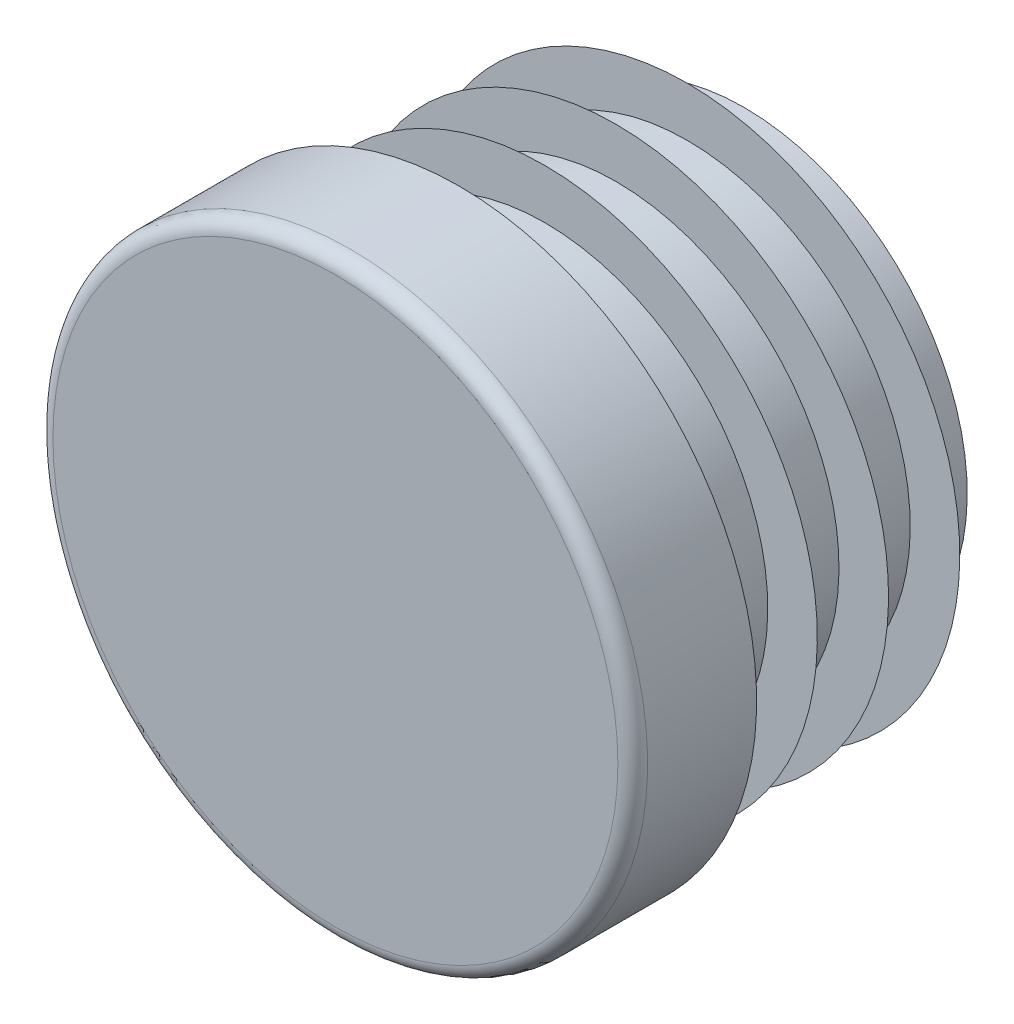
ISO-10303-21;
HEADER;
FILE_DESCRIPTION(('STEP AP214'),'2;1');
FILE_NAME('part.step','',(''),(''),'','','');
FILE_SCHEMA(('AUTOMOTIVE_DESIGN { 1 0 10303 214 1 1 1 1 }'));
ENDSEC;
DATA;
#1=APPLICATION_CONTEXT('core data for automotive mechanical design processes');
#2=APPLICATION_PROTOCOL_DEFINITION('international standard','automotive_design',2000,#1);
#3=PRODUCT_CONTEXT('',#1,'mechanical');
#4=PRODUCT('Part','Part','',(#3));
#5=PRODUCT_RELATED_PRODUCT_CATEGORY('part','',(#4));
#6=PRODUCT_DEFINITION_FORMATION('','',#4);
#7=PRODUCT_DEFINITION_CONTEXT('part definition',#1,'design');
#8=PRODUCT_DEFINITION('design','',#6,#7);
#9=PRODUCT_DEFINITION_SHAPE('','',#8);
#10=(LENGTH_UNIT() NAMED_UNIT(*) SI_UNIT(.MILLI.,.METRE.));
#11=(NAMED_UNIT(*) PLANE_ANGLE_UNIT() SI_UNIT($,.RADIAN.));
#12=(NAMED_UNIT(*) SI_UNIT($,.STERADIAN.) SOLID_ANGLE_UNIT());
#13=UNCERTAINTY_MEASURE_WITH_UNIT(LENGTH_MEASURE(1.E-05),#10,'distance_accuracy_value','');
#14=(GEOMETRIC_REPRESENTATION_CONTEXT(3) GLOBAL_UNCERTAINTY_ASSIGNED_CONTEXT((#13)) GLOBAL_UNIT_ASSIGNED_CONTEXT((#10,
#11,#12)) REPRESENTATION_CONTEXT('',''));
#15=CARTESIAN_POINT('',(0.,0.,0.));
#16=DIRECTION('',(0.,0.,1.));
#17=DIRECTION('',(1.,0.,0.));
#18=AXIS2_PLACEMENT_3D('',#15,#16,#17);
#19=CARTESIAN_POINT('',(0.,0.,5.));
#20=DIRECTION('',(0.,0.,-1.));
#21=DIRECTION('',(0.,1.,0.));
#22=AXIS2_PLACEMENT_3D('',#19,#20,#21);
#23=PLANE('',#22);
#24=CARTESIAN_POINT('',(0.,0.,5.));
#25=DIRECTION('',(0.,0.,-1.));
#26=DIRECTION('',(0.,1.,0.));
#27=AXIS2_PLACEMENT_3D('',#24,#25,#26);
#28=CIRCLE('',#27,11.4);
#29=CARTESIAN_POINT('',(0.,11.4,5.));
#30=VERTEX_POINT('',#29);
#31=EDGE_CURVE('E8',#30,#30,#28,.T.);
#32=ORIENTED_EDGE('',*,*,#31,.F.);
#33=EDGE_LOOP('',(#32));
#34=FACE_BOUND('',#33,.T.);
#35=ADVANCED_FACE('F12',(#34),#23,.F.);
#36=CARTESIAN_POINT('',(0.,0.,4.4));
#37=DIRECTION('',(0.,0.,-1.));
#38=DIRECTION('',(0.,1.,0.));
#39=AXIS2_PLACEMENT_3D('',#36,#37,#38);
#40=TOROIDAL_SURFACE('',#39,11.4,0.6);
#41=ORIENTED_EDGE('',*,*,#31,.T.);
#42=EDGE_LOOP('',(#41));
#43=FACE_BOUND('',#42,.T.);
#44=CARTESIAN_POINT('',(0.,0.,4.4));
#45=DIRECTION('',(0.,0.,-1.));
#46=DIRECTION('',(0.,1.,0.));
#47=AXIS2_PLACEMENT_3D('',#44,#45,#46);
#48=CIRCLE('',#47,12.);
#49=CARTESIAN_POINT('',(0.,12.,4.4));
#50=VERTEX_POINT('',#49);
#51=EDGE_CURVE('E18',#50,#50,#48,.T.);
#52=ORIENTED_EDGE('',*,*,#51,.F.);
#53=EDGE_LOOP('',(#52));
#54=FACE_BOUND('',#53,.T.);
#55=ADVANCED_FACE('F159',(#43,#54),#40,.T.);
#56=CARTESIAN_POINT('',(0.,0.,-11.5));
#57=DIRECTION('',(0.,0.,-1.));
#58=DIRECTION('',(0.,1.,0.));
#59=AXIS2_PLACEMENT_3D('',#56,#57,#58);
#60=CYLINDRICAL_SURFACE('',#59,12.);
#61=CARTESIAN_POINT('',(0.,0.,0.));
#62=DIRECTION('',(0.,0.,-1.));
#63=DIRECTION('',(0.,1.,0.));
#64=AXIS2_PLACEMENT_3D('',#61,#62,#63);
#65=CIRCLE('',#64,12.);
#66=CARTESIAN_POINT('',(0.,12.,0.));
#67=VERTEX_POINT('',#66);
#68=EDGE_CURVE('E22',#67,#67,#65,.T.);
#69=ORIENTED_EDGE('',*,*,#68,.F.);
#70=EDGE_LOOP('',(#69));
#71=FACE_BOUND('',#70,.T.);
#72=ORIENTED_EDGE('',*,*,#51,.T.);
#73=EDGE_LOOP('',(#72));
#74=FACE_BOUND('',#73,.T.);
#75=ADVANCED_FACE('F154',(#71,#74),#60,.T.);
#76=CARTESIAN_POINT('',(12.,0.,0.));
#77=DIRECTION('',(0.,0.,1.));
#78=DIRECTION('',(0.,-1.,0.));
#79=AXIS2_PLACEMENT_3D('',#76,#77,#78);
#80=PLANE('',#79);
#81=CARTESIAN_POINT('',(0.,0.,0.));
#82=DIRECTION('',(0.,0.,-1.));
#83=DIRECTION('',(0.,1.,0.));
#84=AXIS2_PLACEMENT_3D('',#81,#82,#83);
#85=CIRCLE('',#84,9.);
#86=CARTESIAN_POINT('',(0.,9.,0.));
#87=VERTEX_POINT('',#86);
#88=EDGE_CURVE('E26',#87,#87,#85,.T.);
#89=ORIENTED_EDGE('',*,*,#88,.F.);
#90=EDGE_LOOP('',(#89));
#91=FACE_BOUND('',#90,.T.);
#92=ORIENTED_EDGE('',*,*,#68,.T.);
#93=EDGE_LOOP('',(#92));
#94=FACE_BOUND('',#93,.T.);
#95=ADVANCED_FACE('F148',(#91,#94),#80,.F.);
#96=CARTESIAN_POINT('',(0.,0.,-11.5));
#97=DIRECTION('',(0.,0.,-1.));
#98=DIRECTION('',(0.,1.,0.));
#99=AXIS2_PLACEMENT_3D('',#96,#97,#98);
#100=CYLINDRICAL_SURFACE('',#99,9.);
#101=CARTESIAN_POINT('',(0.,0.,-0.575));
#102=DIRECTION('',(0.,0.,-1.));
#103=DIRECTION('',(0.,1.,0.));
#104=AXIS2_PLACEMENT_3D('',#101,#102,#103);
#105=CIRCLE('',#104,9.);
#106=CARTESIAN_POINT('',(0.,9.,-0.575));
#107=VERTEX_POINT('',#106);
#108=EDGE_CURVE('E31',#107,#107,#105,.T.);
#109=ORIENTED_EDGE('',*,*,#108,.F.);
#110=EDGE_LOOP('',(#109));
#111=FACE_BOUND('',#110,.T.);
#112=ORIENTED_EDGE('',*,*,#88,.T.);
#113=EDGE_LOOP('',(#112));
#114=FACE_BOUND('',#113,.T.);
#115=ADVANCED_FACE('F142',(#111,#114),#100,.T.);
#116=CARTESIAN_POINT('',(9.,0.,-0.575));
#117=DIRECTION('',(0.,0.,-1.));
#118=DIRECTION('',(0.,1.,0.));
#119=AXIS2_PLACEMENT_3D('',#116,#117,#118);
#120=PLANE('',#119);
#121=CARTESIAN_POINT('',(0.,0.,-0.575));
#122=DIRECTION('',(0.,0.,-1.));
#123=DIRECTION('',(0.,1.,0.));
#124=AXIS2_PLACEMENT_3D('',#121,#122,#123);
#125=CIRCLE('',#124,11.);
#126=CARTESIAN_POINT('',(0.,11.,-0.575));
#127=VERTEX_POINT('',#126);
#128=EDGE_CURVE('E34',#127,#127,#125,.T.);
#129=ORIENTED_EDGE('',*,*,#128,.F.);
#130=EDGE_LOOP('',(#129));
#131=FACE_BOUND('',#130,.T.);
#132=ORIENTED_EDGE('',*,*,#108,.T.);
#133=EDGE_LOOP('',(#132));
#134=FACE_BOUND('',#133,.T.);
#135=ADVANCED_FACE('F136',(#131,#134),#120,.F.);
#136=CARTESIAN_POINT('',(0.,0.,-0.575));
#137=DIRECTION('',(0.,0.,1.));
#138=DIRECTION('',(0.,-1.,0.));
#139=AXIS2_PLACEMENT_3D('',#136,#137,#138);
#140=CONICAL_SURFACE('',#139,11.,0.959931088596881);
#141=CARTESIAN_POINT('',(0.,0.,-1.97541507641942));
#142=DIRECTION('',(0.,0.,-1.));
#143=DIRECTION('',(0.,1.,0.));
#144=AXIS2_PLACEMENT_3D('',#141,#142,#143);
#145=CIRCLE('',#144,9.);
#146=CARTESIAN_POINT('',(0.,9.,-1.97541507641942));
#147=VERTEX_POINT('',#146);
#148=EDGE_CURVE('E37',#147,#147,#145,.T.);
#149=ORIENTED_EDGE('',*,*,#148,.F.);
#150=EDGE_LOOP('',(#149));
#151=FACE_BOUND('',#150,.T.);
#152=ORIENTED_EDGE('',*,*,#128,.T.);
#153=EDGE_LOOP('',(#152));
#154=FACE_BOUND('',#153,.T.);
#155=ADVANCED_FACE('F130',(#151,#154),#140,.T.);
#156=CARTESIAN_POINT('',(0.,0.,-11.5));
#157=DIRECTION('',(0.,0.,-1.));
#158=DIRECTION('',(0.,1.,0.));
#159=AXIS2_PLACEMENT_3D('',#156,#157,#158);
#160=CYLINDRICAL_SURFACE('',#159,9.);
#161=CARTESIAN_POINT('',(0.,0.,-3.45));
#162=DIRECTION('',(0.,0.,-1.));
#163=DIRECTION('',(0.,1.,0.));
#164=AXIS2_PLACEMENT_3D('',#161,#162,#163);
#165=CIRCLE('',#164,9.);
#166=CARTESIAN_POINT('',(0.,9.,-3.45));
#167=VERTEX_POINT('',#166);
#168=EDGE_CURVE('E40',#167,#167,#165,.T.);
#169=ORIENTED_EDGE('',*,*,#168,.F.);
#170=EDGE_LOOP('',(#169));
#171=FACE_BOUND('',#170,.T.);
#172=ORIENTED_EDGE('',*,*,#148,.T.);
#173=EDGE_LOOP('',(#172));
#174=FACE_BOUND('',#173,.T.);
#175=ADVANCED_FACE('F124',(#171,#174),#160,.T.);
#176=CARTESIAN_POINT('',(9.,0.,-3.45));
#177=DIRECTION('',(0.,0.,-1.));
#178=DIRECTION('',(0.,1.,0.));
#179=AXIS2_PLACEMENT_3D('',#176,#177,#178);
#180=PLANE('',#179);
#181=CARTESIAN_POINT('',(0.,0.,-3.45));
#182=DIRECTION('',(0.,0.,-1.));
#183=DIRECTION('',(0.,1.,0.));
#184=AXIS2_PLACEMENT_3D('',#181,#182,#183);
#185=CIRCLE('',#184,11.);
#186=CARTESIAN_POINT('',(0.,11.,-3.45));
#187=VERTEX_POINT('',#186);
#188=EDGE_CURVE('E43',#187,#187,#185,.T.);
#189=ORIENTED_EDGE('',*,*,#188,.F.);
#190=EDGE_LOOP('',(#189));
#191=FACE_BOUND('',#190,.T.);
#192=ORIENTED_EDGE('',*,*,#168,.T.);
#193=EDGE_LOOP('',(#192));
#194=FACE_BOUND('',#193,.T.);
#195=ADVANCED_FACE('F118',(#191,#194),#180,.F.);
#196=CARTESIAN_POINT('',(0.,0.,-3.45));
#197=DIRECTION('',(0.,0.,1.));
#198=DIRECTION('',(0.,-1.,0.));
#199=AXIS2_PLACEMENT_3D('',#196,#197,#198);
#200=CONICAL_SURFACE('',#199,11.,0.959931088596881);
#201=CARTESIAN_POINT('',(0.,0.,-4.85041507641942));
#202=DIRECTION('',(0.,0.,-1.));
#203=DIRECTION('',(0.,1.,0.));
#204=AXIS2_PLACEMENT_3D('',#201,#202,#203);
#205=CIRCLE('',#204,9.);
#206=CARTESIAN_POINT('',(0.,9.,-4.85041507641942));
#207=VERTEX_POINT('',#206);
#208=EDGE_CURVE('E46',#207,#207,#205,.T.);
#209=ORIENTED_EDGE('',*,*,#208,.F.);
#210=EDGE_LOOP('',(#209));
#211=FACE_BOUND('',#210,.T.);
#212=ORIENTED_EDGE('',*,*,#188,.T.);
#213=EDGE_LOOP('',(#212));
#214=FACE_BOUND('',#213,.T.);
#215=ADVANCED_FACE('F112',(#211,#214),#200,.T.);
#216=CARTESIAN_POINT('',(0.,0.,-11.5));
#217=DIRECTION('',(0.,0.,-1.));
#218=DIRECTION('',(0.,1.,0.));
#219=AXIS2_PLACEMENT_3D('',#216,#217,#218);
#220=CYLINDRICAL_SURFACE('',#219,9.);
#221=CARTESIAN_POINT('',(0.,0.,-6.325));
#222=DIRECTION('',(0.,0.,-1.));
#223=DIRECTION('',(0.,1.,0.));
#224=AXIS2_PLACEMENT_3D('',#221,#222,#223);
#225=CIRCLE('',#224,9.);
#226=CARTESIAN_POINT('',(0.,9.,-6.325));
#227=VERTEX_POINT('',#226);
#228=EDGE_CURVE('E49',#227,#227,#225,.T.);
#229=ORIENTED_EDGE('',*,*,#228,.F.);
#230=EDGE_LOOP('',(#229));
#231=FACE_BOUND('',#230,.T.);
#232=ORIENTED_EDGE('',*,*,#208,.T.);
#233=EDGE_LOOP('',(#232));
#234=FACE_BOUND('',#233,.T.);
#235=ADVANCED_FACE('F106',(#231,#234),#220,.T.);
#236=CARTESIAN_POINT('',(9.,0.,-6.325));
#237=DIRECTION('',(0.,0.,-1.));
#238=DIRECTION('',(0.,1.,0.));
#239=AXIS2_PLACEMENT_3D('',#236,#237,#238);
#240=PLANE('',#239);
#241=CARTESIAN_POINT('',(0.,0.,-6.325));
#242=DIRECTION('',(0.,0.,-1.));
#243=DIRECTION('',(0.,1.,0.));
#244=AXIS2_PLACEMENT_3D('',#241,#242,#243);
#245=CIRCLE('',#244,11.);
#246=CARTESIAN_POINT('',(0.,11.,-6.325));
#247=VERTEX_POINT('',#246);
#248=EDGE_CURVE('E52',#247,#247,#245,.T.);
#249=ORIENTED_EDGE('',*,*,#248,.F.);
#250=EDGE_LOOP('',(#249));
#251=FACE_BOUND('',#250,.T.);
#252=ORIENTED_EDGE('',*,*,#228,.T.);
#253=EDGE_LOOP('',(#252));
#254=FACE_BOUND('',#253,.T.);
#255=ADVANCED_FACE('F100',(#251,#254),#240,.F.);
#256=CARTESIAN_POINT('',(0.,0.,-6.325));
#257=DIRECTION('',(0.,0.,1.));
#258=DIRECTION('',(0.,-1.,0.));
#259=AXIS2_PLACEMENT_3D('',#256,#257,#258);
#260=CONICAL_SURFACE('',#259,11.,0.959931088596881);
#261=CARTESIAN_POINT('',(0.,0.,-7.72541507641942));
#262=DIRECTION('',(0.,0.,-1.));
#263=DIRECTION('',(0.,1.,0.));
#264=AXIS2_PLACEMENT_3D('',#261,#262,#263);
#265=CIRCLE('',#264,9.);
#266=CARTESIAN_POINT('',(0.,9.,-7.72541507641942));
#267=VERTEX_POINT('',#266);
#268=EDGE_CURVE('E55',#267,#267,#265,.T.);
#269=ORIENTED_EDGE('',*,*,#268,.F.);
#270=EDGE_LOOP('',(#269));
#271=FACE_BOUND('',#270,.T.);
#272=ORIENTED_EDGE('',*,*,#248,.T.);
#273=EDGE_LOOP('',(#272));
#274=FACE_BOUND('',#273,.T.);
#275=ADVANCED_FACE('F94',(#271,#274),#260,.T.);
#276=CARTESIAN_POINT('',(0.,0.,-11.5));
#277=DIRECTION('',(0.,0.,-1.));
#278=DIRECTION('',(0.,1.,0.));
#279=AXIS2_PLACEMENT_3D('',#276,#277,#278);
#280=CYLINDRICAL_SURFACE('',#279,9.);
#281=CARTESIAN_POINT('',(0.,0.,-9.2));
#282=DIRECTION('',(0.,0.,-1.));
#283=DIRECTION('',(0.,1.,0.));
#284=AXIS2_PLACEMENT_3D('',#281,#282,#283);
#285=CIRCLE('',#284,9.);
#286=CARTESIAN_POINT('',(0.,9.,-9.2));
#287=VERTEX_POINT('',#286);
#288=EDGE_CURVE('E58',#287,#287,#285,.T.);
#289=ORIENTED_EDGE('',*,*,#288,.F.);
#290=EDGE_LOOP('',(#289));
#291=FACE_BOUND('',#290,.T.);
#292=ORIENTED_EDGE('',*,*,#268,.T.);
#293=EDGE_LOOP('',(#292));
#294=FACE_BOUND('',#293,.T.);
#295=ADVANCED_FACE('F88',(#291,#294),#280,.T.);
#296=CARTESIAN_POINT('',(9.,0.,-9.2));
#297=DIRECTION('',(0.,0.,-1.));
#298=DIRECTION('',(0.,1.,0.));
#299=AXIS2_PLACEMENT_3D('',#296,#297,#298);
#300=PLANE('',#299);
#301=CARTESIAN_POINT('',(0.,0.,-9.2));
#302=DIRECTION('',(0.,0.,-1.));
#303=DIRECTION('',(0.,1.,0.));
#304=AXIS2_PLACEMENT_3D('',#301,#302,#303);
#305=CIRCLE('',#304,11.);
#306=CARTESIAN_POINT('',(0.,11.,-9.2));
#307=VERTEX_POINT('',#306);
#308=EDGE_CURVE('E61',#307,#307,#305,.T.);
#309=ORIENTED_EDGE('',*,*,#308,.F.);
#310=EDGE_LOOP('',(#309));
#311=FACE_BOUND('',#310,.T.);
#312=ORIENTED_EDGE('',*,*,#288,.T.);
#313=EDGE_LOOP('',(#312));
#314=FACE_BOUND('',#313,.T.);
#315=ADVANCED_FACE('F82',(#311,#314),#300,.F.);
#316=CARTESIAN_POINT('',(0.,0.,-9.2));
#317=DIRECTION('',(0.,0.,1.));
#318=DIRECTION('',(0.,-1.,0.));
#319=AXIS2_PLACEMENT_3D('',#316,#317,#318);
#320=CONICAL_SURFACE('',#319,11.,0.959931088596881);
#321=CARTESIAN_POINT('',(0.,0.,-10.6004150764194));
#322=DIRECTION('',(0.,0.,-1.));
#323=DIRECTION('',(0.,1.,0.));
#324=AXIS2_PLACEMENT_3D('',#321,#322,#323);
#325=CIRCLE('',#324,9.);
#326=CARTESIAN_POINT('',(0.,9.,-10.6004150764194));
#327=VERTEX_POINT('',#326);
#328=EDGE_CURVE('E64',#327,#327,#325,.T.);
#329=ORIENTED_EDGE('',*,*,#328,.F.);
#330=EDGE_LOOP('',(#329));
#331=FACE_BOUND('',#330,.T.);
#332=ORIENTED_EDGE('',*,*,#308,.T.);
#333=EDGE_LOOP('',(#332));
#334=FACE_BOUND('',#333,.T.);
#335=ADVANCED_FACE('F76',(#331,#334),#320,.T.);
#336=CARTESIAN_POINT('',(0.,0.,-11.5));
#337=DIRECTION('',(0.,0.,-1.));
#338=DIRECTION('',(0.,1.,0.));
#339=AXIS2_PLACEMENT_3D('',#336,#337,#338);
#340=CYLINDRICAL_SURFACE('',#339,9.);
#341=CARTESIAN_POINT('',(0.,0.,-11.5));
#342=DIRECTION('',(0.,0.,-1.));
#343=DIRECTION('',(0.,1.,0.));
#344=AXIS2_PLACEMENT_3D('',#341,#342,#343);
#345=CIRCLE('',#344,9.);
#346=CARTESIAN_POINT('',(0.,9.,-11.5));
#347=VERTEX_POINT('',#346);
#348=EDGE_CURVE('E67',#347,#347,#345,.T.);
#349=ORIENTED_EDGE('',*,*,#348,.F.);
#350=EDGE_LOOP('',(#349));
#351=FACE_BOUND('',#350,.T.);
#352=ORIENTED_EDGE('',*,*,#328,.T.);
#353=EDGE_LOOP('',(#352));
#354=FACE_BOUND('',#353,.T.);
#355=ADVANCED_FACE('F73',(#351,#354),#340,.T.);
#356=CARTESIAN_POINT('',(9.,0.,-11.5));
#357=DIRECTION('',(0.,0.,1.));
#358=DIRECTION('',(0.,-1.,0.));
#359=AXIS2_PLACEMENT_3D('',#356,#357,#358);
#360=PLANE('',#359);
#361=ORIENTED_EDGE('',*,*,#348,.T.);
#362=EDGE_LOOP('',(#361));
#363=FACE_BOUND('',#362,.T.);
#364=ADVANCED_FACE('F71',(#363),#360,.F.);
#365=CLOSED_SHELL('',(#35,#55,#75,#95,#115,#135,#155,#175,#195,#215,#235,#255,#275,#295,#315,
#335,#355,#364));
#366=MANIFOLD_SOLID_BREP('B1',#365);
#367=ADVANCED_BREP_SHAPE_REPRESENTATION('',(#18,#366),#14);
#368=SHAPE_DEFINITION_REPRESENTATION(#9,#367);
ENDSEC;
END-ISO-10303-21;
